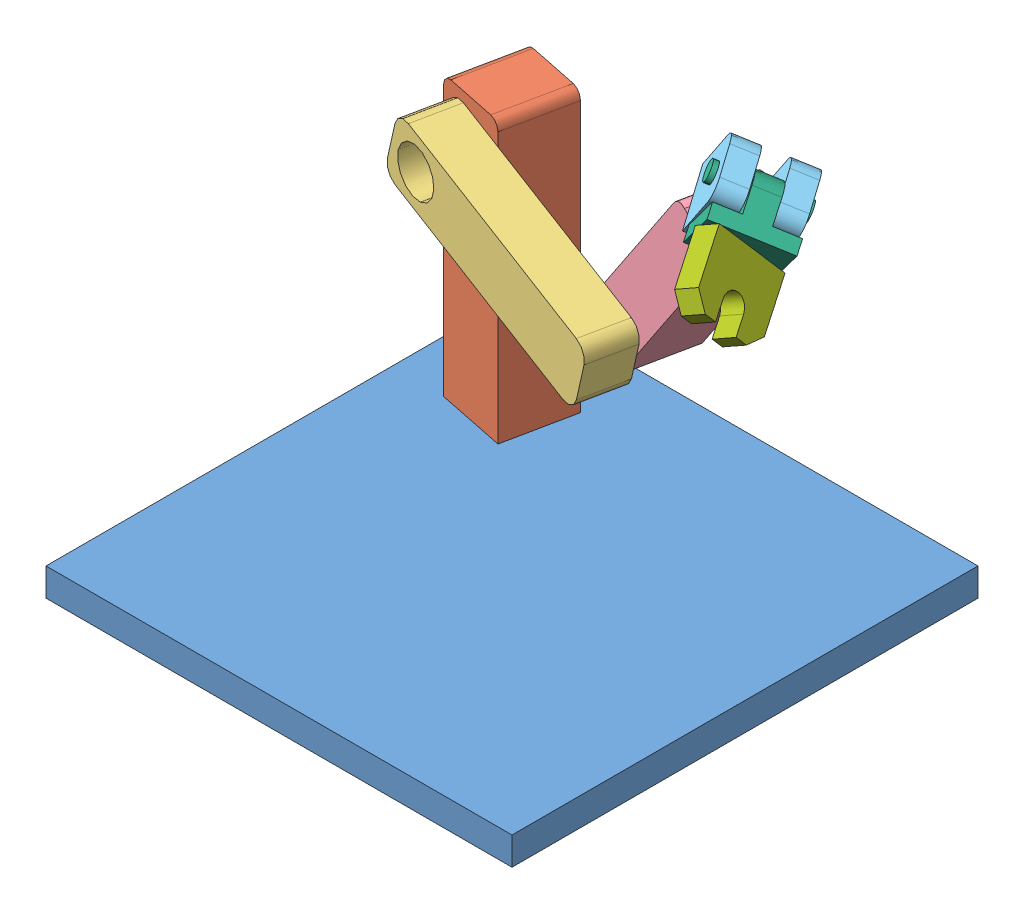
SolidWorks assembly PUMAmech.SLDASM, configuration ﾃﾞﾌｫﾙﾄ (file format 4400). Lengths in mm.
Overall size (1001 955.32 1000).
7 component instances, 7 part files, 12 mates.
Components (placement in the parent):
- Base-1: Base.SLDPRT [ﾃﾞﾌｫﾙﾄ] at (-800.9179 88.559 -500) size (1000 60 1000)
- Link1-1: Link1.SLDPRT [ﾃﾞﾌｫﾙﾄ] at (-689.4836 148.559 -241.638) x (0.979518 0 0.201358) z (0 1 0) size (150 200 650)
- Link2-1: Link2.SLDPRT [ﾃﾞﾌｫﾙﾄ] at (-209.8358 457.847 -40.9464) x (-0.945291 0.262038 -0.194322) z (0.201358 0 -0.979518) size (540 140 250)
- Link3-1: Link3.SLDPRT [ﾃﾞﾌｫﾙﾄ] at (-320.0351 530.7313 -165.691) x (0.578215 0.80718 0.118863) z (0.201358 0 -0.979518) size (490 120 150)
- Link4-1: Link4.SLDPRT [ﾃﾞﾌｫﾙﾄ] at (34.3836 861.6632 -267.0823) x (0.432847 -0.426978 0.793935) z (-0.6916 0.407616 0.596271) size (120 150 150)
- Link5-1: Link5.SLDPRT [ﾃﾞﾌｫﾙﾄ] at (88.9581 973.3012 -28.5356) x (0.6916 -0.407616 -0.596271) z (-0.374749 0.503225 -0.778671) size (170 120 120)
- Link6-1: Link6.SLDPRT [ﾃﾞﾌｫﾙﾄ] at (103.2775 826.5078 -130.294) x (-0.270802 0.743837 0.611042) z (0.886696 0.439853 -0.142478) size (160 170 50)
Mates (geometry in assembly coordinates):
- 同心円1: concentric aligned: cylinder of Link1-1 through (-600.9179 98.559 -300) axis (0 1 0) radius 50; cylinder of Base-1 through (-600.9179 88.559 -300) axis (0 1 0) radius 50
- 一致1: coincident anti-aligned: plane of Base-1 through (-800.9179 148.559 500) normal (0 1 0); plane of Link1-1 through (-659.2799 148.559 -388.5657) normal (0 -1 0)
- 同心円2: concentric aligned: cylinder of Link2-1 through (-636.1556 648.559 -128.5844) axis (0.201358 0 -0.979518) radius 50; cylinder of Link1-1 through (-626.0877 648.559 -177.5603) axis (0.201358 0 -0.979518) radius 50
- 一致2: coincident anti-aligned: plane of Link1-1 through (-689.4836 748.559 -241.638) normal (-0.201358 0 0.979518); plane of Link2-1 through (-153.7661 592.9551 -131.5113) normal (0.201358 0 -0.979518)
- 同心円3: concentric anti-aligned: cylinder of Link2-1 through (-207.6997 543.7437 -295.7349) axis (-0.201358 0 0.979518) radius 40; cylinder of Link3-1 through (-237.9034 543.7437 -148.8073) axis (0.201358 0 -0.979518) radius 40
- 一致3: coincident anti-aligned: plane of Link2-1 through (-153.7661 592.9551 -131.5113) normal (0.201358 0 -0.979518); plane of Link3-1 through (-225.1575 459.8946 -146.1871) normal (-0.201358 0 0.979518)
- 同心円4: concentric aligned: cylinder of Link3-1 through (25.8308 890.831 -171.16) axis (-0.578215 -0.80718 -0.118863) radius 30; cylinder of Link4-1 through (28.7219 894.8669 -170.5657) axis (-0.578215 -0.80718 -0.118863) radius 30
- 一致4: coincident anti-aligned: plane of Link3-1 through (-23.8526 902.034 -257.9417) normal (0.578215 0.80718 0.118863); plane of Link4-1 through (-69.3565 922.8055 -177.6417) normal (-0.578215 -0.80718 -0.118863)
- 同心円5: concentric anti-aligned: cylinder of Link4-1 through (118.1759 916.7625 -207.5599) axis (-0.6916 0.407616 0.596271) radius 20; cylinder of Link5-1 through (7.5199 981.981 -112.1566) axis (0.6916 -0.407616 -0.596271) radius 20
- 一致5: coincident anti-aligned: plane of Link4-1 through (-11.6479 934.7119 -202.7008) normal (0.6916 -0.407616 -0.596271); plane of Link5-1 through (78.5683 1013.3074 -151.7897) normal (-0.6916 0.407616 0.596271)
- 同心円6: concentric aligned: cylinder of Link5-1 through (88.7908 917.1401 -116.1194) axis (0.374749 -0.503225 0.778671) radius 20; cylinder of Link6-1 through (92.5383 912.1079 -108.3327) axis (0.374749 -0.503225 0.778671) radius 15
- 一致6: coincident anti-aligned: plane of Link5-1 through (14.8633 881.8635 -51.9689) normal (0.374749 -0.503225 0.778671); plane of Link6-1 through (147.6123 848.5005 -137.4178) normal (-0.374749 0.503225 -0.778671)
